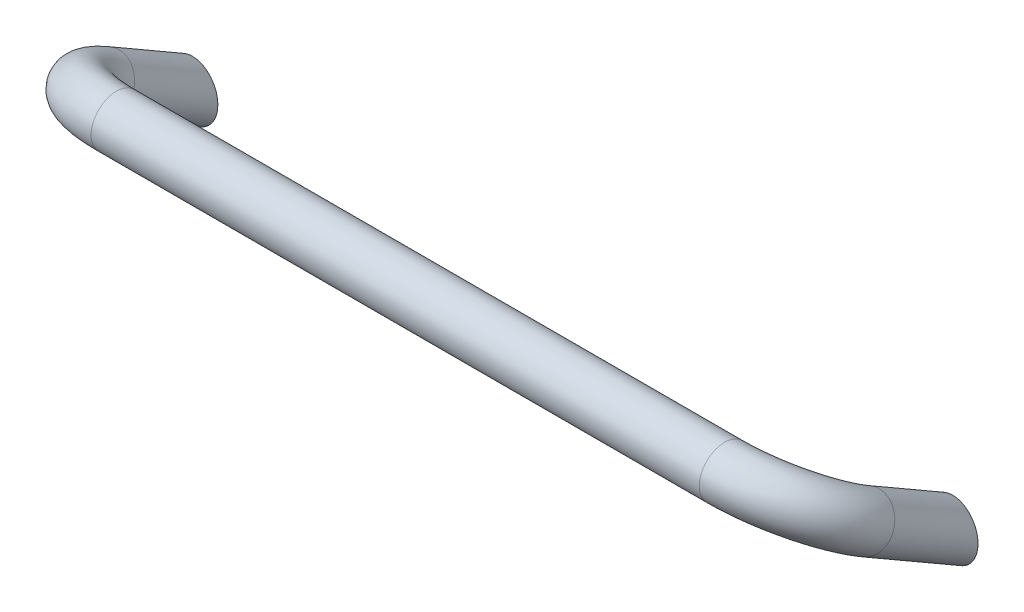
ISO-10303-21;
HEADER;
FILE_DESCRIPTION(('STEP AP214'),'2;1');
FILE_NAME('part.step','',(''),(''),'','','');
FILE_SCHEMA(('AUTOMOTIVE_DESIGN { 1 0 10303 214 1 1 1 1 }'));
ENDSEC;
DATA;
#1=APPLICATION_CONTEXT('core data for automotive mechanical design processes');
#2=APPLICATION_PROTOCOL_DEFINITION('international standard','automotive_design',2000,#1);
#3=PRODUCT_CONTEXT('',#1,'mechanical');
#4=PRODUCT('Part','Part','',(#3));
#5=PRODUCT_RELATED_PRODUCT_CATEGORY('part','',(#4));
#6=PRODUCT_DEFINITION_FORMATION('','',#4);
#7=PRODUCT_DEFINITION_CONTEXT('part definition',#1,'design');
#8=PRODUCT_DEFINITION('design','',#6,#7);
#9=PRODUCT_DEFINITION_SHAPE('','',#8);
#10=(LENGTH_UNIT() NAMED_UNIT(*) SI_UNIT(.MILLI.,.METRE.));
#11=(NAMED_UNIT(*) PLANE_ANGLE_UNIT() SI_UNIT($,.RADIAN.));
#12=(NAMED_UNIT(*) SI_UNIT($,.STERADIAN.) SOLID_ANGLE_UNIT());
#13=UNCERTAINTY_MEASURE_WITH_UNIT(LENGTH_MEASURE(1.E-05),#10,'distance_accuracy_value','');
#14=(GEOMETRIC_REPRESENTATION_CONTEXT(3) GLOBAL_UNCERTAINTY_ASSIGNED_CONTEXT((#13)) GLOBAL_UNIT_ASSIGNED_CONTEXT((#10,
#11,#12)) REPRESENTATION_CONTEXT('',''));
#15=CARTESIAN_POINT('',(0.,0.,0.));
#16=DIRECTION('',(0.,0.,1.));
#17=DIRECTION('',(1.,0.,0.));
#18=AXIS2_PLACEMENT_3D('',#15,#16,#17);
#19=CARTESIAN_POINT('',(300.,0.,-5.68396051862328E-11));
#20=DIRECTION('',(0.,0.,-1.));
#21=DIRECTION('',(0.,1.,0.));
#22=AXIS2_PLACEMENT_3D('',#19,#20,#21);
#23=CONICAL_SURFACE('',#22,4.25000000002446,0.785398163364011);
#24=CARTESIAN_POINT('',(300.,0.,0.249999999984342));
#25=DIRECTION('',(0.,0.,-1.));
#26=DIRECTION('',(0.,1.,0.));
#27=AXIS2_PLACEMENT_3D('',#24,#25,#26);
#28=CIRCLE('',#27,4.);
#29=CARTESIAN_POINT('',(300.,4.,0.249999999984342));
#30=VERTEX_POINT('',#29);
#31=EDGE_CURVE('E15',#30,#30,#28,.F.);
#32=ORIENTED_EDGE('',*,*,#31,.T.);
#33=EDGE_LOOP('',(#32));
#34=FACE_BOUND('',#33,.T.);
#35=CARTESIAN_POINT('',(300.,0.,-5.68396051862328E-11));
#36=DIRECTION('',(0.,0.,-1.));
#37=DIRECTION('',(0.,1.,0.));
#38=AXIS2_PLACEMENT_3D('',#35,#36,#37);
#39=CIRCLE('',#38,4.25000000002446);
#40=CARTESIAN_POINT('',(300.,4.25000000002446,-5.68396051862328E-11));
#41=VERTEX_POINT('',#40);
#42=EDGE_CURVE('E105',#41,#41,#39,.T.);
#43=ORIENTED_EDGE('',*,*,#42,.T.);
#44=EDGE_LOOP('',(#43));
#45=FACE_BOUND('',#44,.T.);
#46=ADVANCED_FACE('F12',(#34,#45),#23,.F.);
#47=CARTESIAN_POINT('',(0.,0.,-5.68396051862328E-11));
#48=DIRECTION('',(0.,0.,-1.));
#49=DIRECTION('',(0.,1.,0.));
#50=AXIS2_PLACEMENT_3D('',#47,#48,#49);
#51=CONICAL_SURFACE('',#50,4.25000000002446,0.785398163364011);
#52=CARTESIAN_POINT('',(0.,0.,0.249999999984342));
#53=DIRECTION('',(0.,0.,-1.));
#54=DIRECTION('',(0.,1.,0.));
#55=AXIS2_PLACEMENT_3D('',#52,#53,#54);
#56=CIRCLE('',#55,4.);
#57=CARTESIAN_POINT('',(0.,4.,0.249999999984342));
#58=VERTEX_POINT('',#57);
#59=EDGE_CURVE('E100',#58,#58,#56,.F.);
#60=ORIENTED_EDGE('',*,*,#59,.T.);
#61=EDGE_LOOP('',(#60));
#62=FACE_BOUND('',#61,.T.);
#63=CARTESIAN_POINT('',(0.,0.,-5.68396051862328E-11));
#64=DIRECTION('',(0.,0.,-1.));
#65=DIRECTION('',(0.,1.,0.));
#66=AXIS2_PLACEMENT_3D('',#63,#64,#65);
#67=CIRCLE('',#66,4.25000000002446);
#68=CARTESIAN_POINT('',(0.,4.25000000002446,-5.68396051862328E-11));
#69=VERTEX_POINT('',#68);
#70=EDGE_CURVE('E109',#69,#69,#67,.T.);
#71=ORIENTED_EDGE('',*,*,#70,.T.);
#72=EDGE_LOOP('',(#71));
#73=FACE_BOUND('',#72,.T.);
#74=ADVANCED_FACE('F60',(#62,#73),#51,.F.);
#75=CARTESIAN_POINT('',(-10.,31.1410161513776,0.));
#76=DIRECTION('',(0.,0.,1.));
#77=DIRECTION('',(0.,-1.,0.));
#78=AXIS2_PLACEMENT_3D('',#75,#76,#77);
#79=PLANE('',#78);
#80=ORIENTED_EDGE('',*,*,#42,.F.);
#81=EDGE_LOOP('',(#80));
#82=FACE_BOUND('',#81,.T.);
#83=CARTESIAN_POINT('',(300.,-3.5,0.));
#84=DIRECTION('',(0.,0.,1.));
#85=DIRECTION('',(0.,1.,0.));
#86=AXIS2_PLACEMENT_3D('',#83,#84,#85);
#87=ELLIPSE('',#86,11.5470053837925,10.);
#88=CARTESIAN_POINT('',(300.,8.04700538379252,0.));
#89=VERTEX_POINT('',#88);
#90=EDGE_CURVE('E112',#89,#89,#87,.T.);
#91=ORIENTED_EDGE('',*,*,#90,.F.);
#92=EDGE_LOOP('',(#91));
#93=FACE_BOUND('',#92,.T.);
#94=ADVANCED_FACE('F57',(#82,#93),#79,.F.);
#95=CARTESIAN_POINT('',(-10.,31.1410161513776,0.));
#96=DIRECTION('',(0.,0.,1.));
#97=DIRECTION('',(0.,-1.,0.));
#98=AXIS2_PLACEMENT_3D('',#95,#96,#97);
#99=PLANE('',#98);
#100=ORIENTED_EDGE('',*,*,#70,.F.);
#101=EDGE_LOOP('',(#100));
#102=FACE_BOUND('',#101,.T.);
#103=CARTESIAN_POINT('',(0.,-3.5,0.));
#104=DIRECTION('',(0.,0.,1.));
#105=DIRECTION('',(0.,1.,0.));
#106=AXIS2_PLACEMENT_3D('',#103,#104,#105);
#107=ELLIPSE('',#106,11.5470053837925,10.);
#108=CARTESIAN_POINT('',(0.,8.04700538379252,0.));
#109=VERTEX_POINT('',#108);
#110=EDGE_CURVE('E115',#109,#109,#107,.T.);
#111=ORIENTED_EDGE('',*,*,#110,.F.);
#112=EDGE_LOOP('',(#111));
#113=FACE_BOUND('',#112,.T.);
#114=ADVANCED_FACE('F53',(#102,#113),#99,.F.);
#115=CARTESIAN_POINT('',(300.,16.1410161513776,34.0192378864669));
#116=DIRECTION('',(0.,0.5,0.866025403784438));
#117=DIRECTION('',(0.,-0.866025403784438,0.5));
#118=AXIS2_PLACEMENT_3D('',#115,#116,#117);
#119=CYLINDRICAL_SURFACE('',#118,10.);
#120=ORIENTED_EDGE('',*,*,#90,.T.);
#121=EDGE_LOOP('',(#120));
#122=FACE_BOUND('',#121,.T.);
#123=CARTESIAN_POINT('',(300.,16.1410161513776,34.0192378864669));
#124=DIRECTION('',(0.,-0.5,-0.866025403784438));
#125=DIRECTION('',(1.,0.,0.));
#126=AXIS2_PLACEMENT_3D('',#123,#124,#125);
#127=CIRCLE('',#126,10.);
#128=CARTESIAN_POINT('',(310.,16.1410161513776,34.0192378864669));
#129=VERTEX_POINT('',#128);
#130=EDGE_CURVE('E118',#129,#129,#127,.F.);
#131=ORIENTED_EDGE('',*,*,#130,.F.);
#132=EDGE_LOOP('',(#131));
#133=FACE_BOUND('',#132,.T.);
#134=ADVANCED_FACE('F49',(#122,#133),#119,.T.);
#135=CARTESIAN_POINT('',(0.,16.1410161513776,34.0192378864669));
#136=DIRECTION('',(0.,0.5,0.866025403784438));
#137=DIRECTION('',(0.,-0.866025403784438,0.5));
#138=AXIS2_PLACEMENT_3D('',#135,#136,#137);
#139=CYLINDRICAL_SURFACE('',#138,10.);
#140=CARTESIAN_POINT('',(0.,16.1410161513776,34.0192378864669));
#141=DIRECTION('',(0.,-0.5,-0.866025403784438));
#142=DIRECTION('',(-1.,0.,0.));
#143=AXIS2_PLACEMENT_3D('',#140,#141,#142);
#144=CIRCLE('',#143,10.);
#145=CARTESIAN_POINT('',(-10.,16.1410161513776,34.0192378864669));
#146=VERTEX_POINT('',#145);
#147=EDGE_CURVE('E24',#146,#146,#144,.F.);
#148=ORIENTED_EDGE('',*,*,#147,.F.);
#149=EDGE_LOOP('',(#148));
#150=FACE_BOUND('',#149,.T.);
#151=ORIENTED_EDGE('',*,*,#110,.T.);
#152=EDGE_LOOP('',(#151));
#153=FACE_BOUND('',#152,.T.);
#154=ADVANCED_FACE('F45',(#150,#153),#139,.T.);
#155=CARTESIAN_POINT('',(270.,16.1410161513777,34.0192378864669));
#156=DIRECTION('',(0.,0.866025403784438,-0.5));
#157=DIRECTION('',(0.,0.5,0.866025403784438));
#158=AXIS2_PLACEMENT_3D('',#155,#156,#157);
#159=TOROIDAL_SURFACE('',#158,30.,10.);
#160=ORIENTED_EDGE('',*,*,#130,.T.);
#161=EDGE_LOOP('',(#160));
#162=FACE_BOUND('',#161,.T.);
#163=CARTESIAN_POINT('',(270.,31.1410161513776,60.));
#164=DIRECTION('',(1.,0.,0.));
#165=DIRECTION('',(0.,1.,0.));
#166=AXIS2_PLACEMENT_3D('',#163,#164,#165);
#167=CIRCLE('',#166,10.);
#168=CARTESIAN_POINT('',(270.,41.1410161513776,60.));
#169=VERTEX_POINT('',#168);
#170=EDGE_CURVE('E19',#169,#169,#167,.F.);
#171=ORIENTED_EDGE('',*,*,#170,.F.);
#172=EDGE_LOOP('',(#171));
#173=FACE_BOUND('',#172,.T.);
#174=ADVANCED_FACE('F40',(#162,#173),#159,.T.);
#175=CARTESIAN_POINT('',(30.,16.1410161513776,34.0192378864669));
#176=DIRECTION('',(0.,-0.866025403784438,0.5));
#177=DIRECTION('',(0.,-0.5,-0.866025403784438));
#178=AXIS2_PLACEMENT_3D('',#175,#176,#177);
#179=TOROIDAL_SURFACE('',#178,30.,10.);
#180=ORIENTED_EDGE('',*,*,#147,.T.);
#181=EDGE_LOOP('',(#180));
#182=FACE_BOUND('',#181,.T.);
#183=CARTESIAN_POINT('',(30.,31.1410161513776,60.));
#184=DIRECTION('',(1.,0.,0.));
#185=DIRECTION('',(0.,1.,0.));
#186=AXIS2_PLACEMENT_3D('',#183,#184,#185);
#187=CIRCLE('',#186,10.);
#188=CARTESIAN_POINT('',(30.,41.1410161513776,60.));
#189=VERTEX_POINT('',#188);
#190=EDGE_CURVE('E8',#189,#189,#187,.T.);
#191=ORIENTED_EDGE('',*,*,#190,.F.);
#192=EDGE_LOOP('',(#191));
#193=FACE_BOUND('',#192,.T.);
#194=ADVANCED_FACE('F35',(#182,#193),#179,.T.);
#195=CARTESIAN_POINT('',(270.,31.1410161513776,60.));
#196=DIRECTION('',(1.,0.,0.));
#197=DIRECTION('',(0.,1.,0.));
#198=AXIS2_PLACEMENT_3D('',#195,#196,#197);
#199=CYLINDRICAL_SURFACE('',#198,10.);
#200=ORIENTED_EDGE('',*,*,#170,.T.);
#201=EDGE_LOOP('',(#200));
#202=FACE_BOUND('',#201,.T.);
#203=ORIENTED_EDGE('',*,*,#190,.T.);
#204=EDGE_LOOP('',(#203));
#205=FACE_BOUND('',#204,.T.);
#206=ADVANCED_FACE('F39',(#202,#205),#199,.T.);
#207=CARTESIAN_POINT('',(0.,0.,12.));
#208=DIRECTION('',(0.,0.,-1.));
#209=DIRECTION('',(0.,1.,0.));
#210=AXIS2_PLACEMENT_3D('',#207,#208,#209);
#211=PLANE('',#210);
#212=CARTESIAN_POINT('',(0.,0.,12.));
#213=DIRECTION('',(0.,0.,-1.));
#214=DIRECTION('',(0.,1.,0.));
#215=AXIS2_PLACEMENT_3D('',#212,#213,#214);
#216=CIRCLE('',#215,4.);
#217=CARTESIAN_POINT('',(0.,4.,12.));
#218=VERTEX_POINT('',#217);
#219=EDGE_CURVE('E27',#218,#218,#216,.T.);
#220=ORIENTED_EDGE('',*,*,#219,.T.);
#221=EDGE_LOOP('',(#220));
#222=FACE_BOUND('',#221,.T.);
#223=ADVANCED_FACE('F69',(#222),#211,.T.);
#224=CARTESIAN_POINT('',(0.,0.,12.));
#225=DIRECTION('',(0.,0.,-1.));
#226=DIRECTION('',(0.,1.,0.));
#227=AXIS2_PLACEMENT_3D('',#224,#225,#226);
#228=CYLINDRICAL_SURFACE('',#227,4.);
#229=ORIENTED_EDGE('',*,*,#219,.F.);
#230=EDGE_LOOP('',(#229));
#231=FACE_BOUND('',#230,.T.);
#232=ORIENTED_EDGE('',*,*,#59,.F.);
#233=EDGE_LOOP('',(#232));
#234=FACE_BOUND('',#233,.T.);
#235=ADVANCED_FACE('F77',(#231,#234),#228,.F.);
#236=CARTESIAN_POINT('',(300.,0.,12.));
#237=DIRECTION('',(0.,0.,-1.));
#238=DIRECTION('',(0.,1.,0.));
#239=AXIS2_PLACEMENT_3D('',#236,#237,#238);
#240=PLANE('',#239);
#241=CARTESIAN_POINT('',(300.,0.,12.));
#242=DIRECTION('',(0.,0.,-1.));
#243=DIRECTION('',(0.,1.,0.));
#244=AXIS2_PLACEMENT_3D('',#241,#242,#243);
#245=CIRCLE('',#244,4.);
#246=CARTESIAN_POINT('',(300.,4.,12.));
#247=VERTEX_POINT('',#246);
#248=EDGE_CURVE('E99',#247,#247,#245,.T.);
#249=ORIENTED_EDGE('',*,*,#248,.T.);
#250=EDGE_LOOP('',(#249));
#251=FACE_BOUND('',#250,.T.);
#252=ADVANCED_FACE('F85',(#251),#240,.T.);
#253=CARTESIAN_POINT('',(300.,0.,12.));
#254=DIRECTION('',(0.,0.,-1.));
#255=DIRECTION('',(0.,1.,0.));
#256=AXIS2_PLACEMENT_3D('',#253,#254,#255);
#257=CYLINDRICAL_SURFACE('',#256,4.);
#258=ORIENTED_EDGE('',*,*,#248,.F.);
#259=EDGE_LOOP('',(#258));
#260=FACE_BOUND('',#259,.T.);
#261=ORIENTED_EDGE('',*,*,#31,.F.);
#262=EDGE_LOOP('',(#261));
#263=FACE_BOUND('',#262,.T.);
#264=ADVANCED_FACE('F89',(#260,#263),#257,.F.);
#265=CLOSED_SHELL('',(#46,#74,#94,#114,#134,#154,#174,#194,#206,#223,#235,#252,#264));
#266=MANIFOLD_SOLID_BREP('B1',#265);
#267=ADVANCED_BREP_SHAPE_REPRESENTATION('',(#18,#266),#14);
#268=SHAPE_DEFINITION_REPRESENTATION(#9,#267);
ENDSEC;
END-ISO-10303-21;
